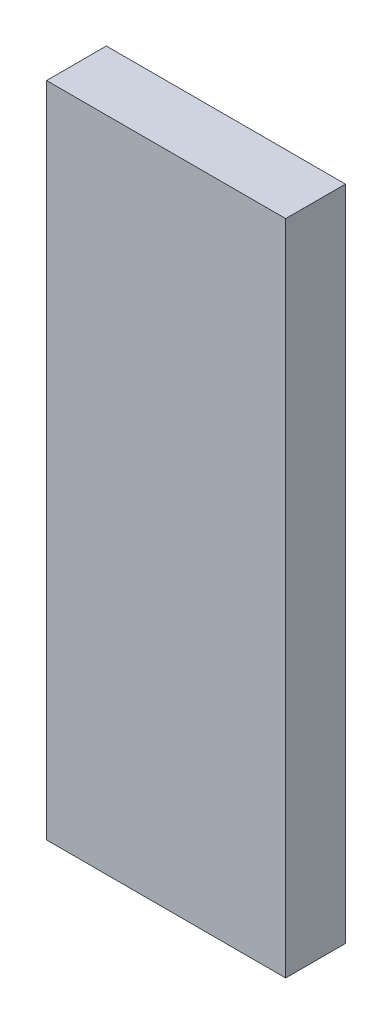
ISO-10303-21;
HEADER;
FILE_DESCRIPTION(('STEP AP214'),'2;1');
FILE_NAME('part.step','',(''),(''),'','','');
FILE_SCHEMA(('AUTOMOTIVE_DESIGN { 1 0 10303 214 1 1 1 1 }'));
ENDSEC;
DATA;
#1=APPLICATION_CONTEXT('core data for automotive mechanical design processes');
#2=APPLICATION_PROTOCOL_DEFINITION('international standard','automotive_design',2000,#1);
#3=PRODUCT_CONTEXT('',#1,'mechanical');
#4=PRODUCT('Part','Part','',(#3));
#5=PRODUCT_RELATED_PRODUCT_CATEGORY('part','',(#4));
#6=PRODUCT_DEFINITION_FORMATION('','',#4);
#7=PRODUCT_DEFINITION_CONTEXT('part definition',#1,'design');
#8=PRODUCT_DEFINITION('design','',#6,#7);
#9=PRODUCT_DEFINITION_SHAPE('','',#8);
#10=(LENGTH_UNIT() NAMED_UNIT(*) SI_UNIT(.MILLI.,.METRE.));
#11=(NAMED_UNIT(*) PLANE_ANGLE_UNIT() SI_UNIT($,.RADIAN.));
#12=(NAMED_UNIT(*) SI_UNIT($,.STERADIAN.) SOLID_ANGLE_UNIT());
#13=UNCERTAINTY_MEASURE_WITH_UNIT(LENGTH_MEASURE(1.E-05),#10,'distance_accuracy_value','');
#14=(GEOMETRIC_REPRESENTATION_CONTEXT(3) GLOBAL_UNCERTAINTY_ASSIGNED_CONTEXT((#13)) GLOBAL_UNIT_ASSIGNED_CONTEXT((#10,
#11,#12)) REPRESENTATION_CONTEXT('',''));
#15=CARTESIAN_POINT('',(0.,0.,0.));
#16=DIRECTION('',(0.,0.,1.));
#17=DIRECTION('',(1.,0.,0.));
#18=AXIS2_PLACEMENT_3D('',#15,#16,#17);
#19=CARTESIAN_POINT('',(-10.,27.5,5.));
#20=DIRECTION('',(1.,0.,0.));
#21=DIRECTION('',(0.,1.,0.));
#22=AXIS2_PLACEMENT_3D('',#19,#20,#21);
#23=PLANE('',#22);
#24=DIRECTION('',(0.,-1.,0.));
#25=VECTOR('',#24,1.);
#26=CARTESIAN_POINT('',(-10.,27.5,0.));
#27=LINE('',#26,#25);
#28=CARTESIAN_POINT('',(-10.,27.5,0.));
#29=VERTEX_POINT('',#28);
#30=CARTESIAN_POINT('',(-9.99999999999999,-27.5,0.));
#31=VERTEX_POINT('',#30);
#32=EDGE_CURVE('E98',#29,#31,#27,.T.);
#33=ORIENTED_EDGE('',*,*,#32,.T.);
#34=DIRECTION('',(0.,0.,-1.));
#35=VECTOR('',#34,1.);
#36=CARTESIAN_POINT('',(-9.99999999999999,-27.5,5.));
#37=LINE('',#36,#35);
#38=CARTESIAN_POINT('',(-9.99999999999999,-27.5,5.));
#39=VERTEX_POINT('',#38);
#40=EDGE_CURVE('E11',#39,#31,#37,.T.);
#41=ORIENTED_EDGE('',*,*,#40,.F.);
#42=DIRECTION('',(0.,-1.,0.));
#43=VECTOR('',#42,1.);
#44=CARTESIAN_POINT('',(-10.,27.5,5.));
#45=LINE('',#44,#43);
#46=CARTESIAN_POINT('',(-10.,27.5,5.));
#47=VERTEX_POINT('',#46);
#48=EDGE_CURVE('E86',#47,#39,#45,.T.);
#49=ORIENTED_EDGE('',*,*,#48,.F.);
#50=DIRECTION('',(0.,0.,-1.));
#51=VECTOR('',#50,1.);
#52=CARTESIAN_POINT('',(-10.,27.5,5.));
#53=LINE('',#52,#51);
#54=EDGE_CURVE('E94',#47,#29,#53,.T.);
#55=ORIENTED_EDGE('',*,*,#54,.T.);
#56=EDGE_LOOP('',(#33,#41,#49,#55));
#57=FACE_BOUND('',#56,.T.);
#58=ADVANCED_FACE('F35',(#57),#23,.F.);
#59=CARTESIAN_POINT('',(-9.99999999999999,-27.5,5.));
#60=DIRECTION('',(0.,1.,0.));
#61=DIRECTION('',(-1.,0.,0.));
#62=AXIS2_PLACEMENT_3D('',#59,#60,#61);
#63=PLANE('',#62);
#64=DIRECTION('',(1.,0.,0.));
#65=VECTOR('',#64,1.);
#66=CARTESIAN_POINT('',(-9.99999999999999,-27.5,0.));
#67=LINE('',#66,#65);
#68=CARTESIAN_POINT('',(10.,-27.5,0.));
#69=VERTEX_POINT('',#68);
#70=EDGE_CURVE('E90',#31,#69,#67,.T.);
#71=ORIENTED_EDGE('',*,*,#70,.T.);
#72=DIRECTION('',(0.,0.,-1.));
#73=VECTOR('',#72,1.);
#74=CARTESIAN_POINT('',(10.,-27.5,5.));
#75=LINE('',#74,#73);
#76=CARTESIAN_POINT('',(10.,-27.5,5.));
#77=VERTEX_POINT('',#76);
#78=EDGE_CURVE('E43',#77,#69,#75,.T.);
#79=ORIENTED_EDGE('',*,*,#78,.F.);
#80=DIRECTION('',(1.,0.,0.));
#81=VECTOR('',#80,1.);
#82=CARTESIAN_POINT('',(-9.99999999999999,-27.5,5.));
#83=LINE('',#82,#81);
#84=EDGE_CURVE('E81',#39,#77,#83,.T.);
#85=ORIENTED_EDGE('',*,*,#84,.F.);
#86=ORIENTED_EDGE('',*,*,#40,.T.);
#87=EDGE_LOOP('',(#71,#79,#85,#86));
#88=FACE_BOUND('',#87,.T.);
#89=ADVANCED_FACE('F89',(#88),#63,.F.);
#90=CARTESIAN_POINT('',(10.,27.5,5.));
#91=DIRECTION('',(-1.,0.,0.));
#92=DIRECTION('',(0.,-1.,0.));
#93=AXIS2_PLACEMENT_3D('',#90,#91,#92);
#94=PLANE('',#93);
#95=DIRECTION('',(0.,1.,0.));
#96=VECTOR('',#95,1.);
#97=CARTESIAN_POINT('',(10.,27.5,0.));
#98=LINE('',#97,#96);
#99=CARTESIAN_POINT('',(10.,27.5,0.));
#100=VERTEX_POINT('',#99);
#101=EDGE_CURVE('E68',#69,#100,#98,.T.);
#102=ORIENTED_EDGE('',*,*,#101,.T.);
#103=DIRECTION('',(0.,0.,-1.));
#104=VECTOR('',#103,1.);
#105=CARTESIAN_POINT('',(10.,27.5,5.));
#106=LINE('',#105,#104);
#107=CARTESIAN_POINT('',(10.,27.5,5.));
#108=VERTEX_POINT('',#107);
#109=EDGE_CURVE('E91',#108,#100,#106,.T.);
#110=ORIENTED_EDGE('',*,*,#109,.F.);
#111=DIRECTION('',(0.,1.,0.));
#112=VECTOR('',#111,1.);
#113=CARTESIAN_POINT('',(10.,27.5,5.));
#114=LINE('',#113,#112);
#115=EDGE_CURVE('E84',#77,#108,#114,.T.);
#116=ORIENTED_EDGE('',*,*,#115,.F.);
#117=ORIENTED_EDGE('',*,*,#78,.T.);
#118=EDGE_LOOP('',(#102,#110,#116,#117));
#119=FACE_BOUND('',#118,.T.);
#120=ADVANCED_FACE('F92',(#119),#94,.F.);
#121=CARTESIAN_POINT('',(-10.,27.5,5.));
#122=DIRECTION('',(0.,-1.,0.));
#123=DIRECTION('',(0.,0.,-1.));
#124=AXIS2_PLACEMENT_3D('',#121,#122,#123);
#125=PLANE('',#124);
#126=DIRECTION('',(-1.,0.,0.));
#127=VECTOR('',#126,1.);
#128=CARTESIAN_POINT('',(-10.,27.5,0.));
#129=LINE('',#128,#127);
#130=EDGE_CURVE('E74',#100,#29,#129,.T.);
#131=ORIENTED_EDGE('',*,*,#130,.T.);
#132=ORIENTED_EDGE('',*,*,#54,.F.);
#133=DIRECTION('',(-1.,0.,0.));
#134=VECTOR('',#133,1.);
#135=CARTESIAN_POINT('',(-10.,27.5,5.));
#136=LINE('',#135,#134);
#137=EDGE_CURVE('E51',#108,#47,#136,.T.);
#138=ORIENTED_EDGE('',*,*,#137,.F.);
#139=ORIENTED_EDGE('',*,*,#109,.T.);
#140=EDGE_LOOP('',(#131,#132,#138,#139));
#141=FACE_BOUND('',#140,.T.);
#142=ADVANCED_FACE('F105',(#141),#125,.F.);
#143=CARTESIAN_POINT('',(-9.99999999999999,-27.5,5.));
#144=DIRECTION('',(0.,0.,1.));
#145=DIRECTION('',(1.,0.,0.));
#146=AXIS2_PLACEMENT_3D('',#143,#144,#145);
#147=PLANE('',#146);
#148=ORIENTED_EDGE('',*,*,#48,.T.);
#149=ORIENTED_EDGE('',*,*,#84,.T.);
#150=ORIENTED_EDGE('',*,*,#115,.T.);
#151=ORIENTED_EDGE('',*,*,#137,.T.);
#152=EDGE_LOOP('',(#148,#149,#150,#151));
#153=FACE_BOUND('',#152,.T.);
#154=ADVANCED_FACE('F82',(#153),#147,.T.);
#155=CARTESIAN_POINT('',(-9.99999999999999,-27.5,0.));
#156=DIRECTION('',(0.,0.,1.));
#157=DIRECTION('',(1.,0.,0.));
#158=AXIS2_PLACEMENT_3D('',#155,#156,#157);
#159=PLANE('',#158);
#160=ORIENTED_EDGE('',*,*,#32,.F.);
#161=ORIENTED_EDGE('',*,*,#130,.F.);
#162=ORIENTED_EDGE('',*,*,#101,.F.);
#163=ORIENTED_EDGE('',*,*,#70,.F.);
#164=EDGE_LOOP('',(#160,#161,#162,#163));
#165=FACE_BOUND('',#164,.T.);
#166=ADVANCED_FACE('F108',(#165),#159,.F.);
#167=CLOSED_SHELL('',(#58,#89,#120,#142,#154,#166));
#168=MANIFOLD_SOLID_BREP('B2',#167);
#169=ADVANCED_BREP_SHAPE_REPRESENTATION('',(#18,#168),#14);
#170=SHAPE_DEFINITION_REPRESENTATION(#9,#169);
ENDSEC;
END-ISO-10303-21;
